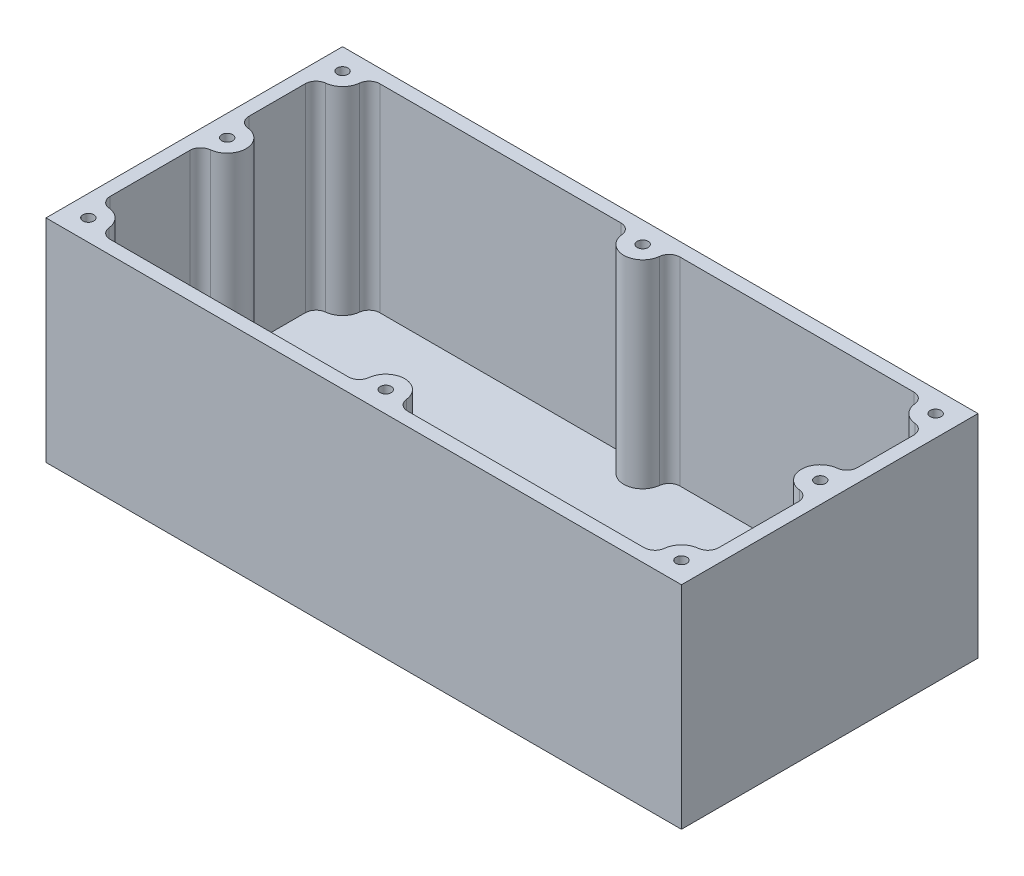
from build123d import *

# Parameters (mm, degrees)
SKETCH1_W             = 150
SKETCH1_H             = 70
BOSS_EXTRUDE1_DEPTH   = 50
F_5_40_TAPPED_HOLE1_D = 2.5781
SHELL1_T              = -3.175
FILLET5_R             = 2.54


with BuildPart() as part:
    # Sketch1 → Boss-Extrude1 (new body)
    with BuildSketch(Plane(origin=(0, 0, 0), x_dir=(1, 0, 0), z_dir=(0, 1, 0))):
        Rectangle(SKETCH1_W, SKETCH1_H)
    extrude(amount=BOSS_EXTRUDE1_DEPTH)

    # 5-40 Tapped Hole1 (through all)
    with Locations(Plane(origin=(0, 50, 0), x_dir=(1, 0, 0), z_dir=(0, 1, 0))):
        with Locations((70, 30), (70, 2.761337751), (70, -30), (0.19808968, -30), (0.846805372, 30), (-70, 30), (-70, 2.761337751), (-70, -30)):
            Hole(F_5_40_TAPPED_HOLE1_D / 2)

    # Shell1
    shell1_openings = [part.faces().sort_by_distance(p)[0] for p in [
        (-0.000521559, 50, 0.002756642),
    ]]
    offset(amount=SHELL1_T, openings=shell1_openings, kind=Kind.INTERSECTION)

    # Fillet5
    fillet5_edges = [part.edges().sort_by_distance(p)[0] for p in [
        (71.825, 26.5875, 25.926044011),
        (-65.926044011, 26.5875, -31.825),
        (-71.825, 26.5875, 25.926044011),
        (-65.926044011, 26.5875, 31.825),
        (-71.825, 26.5875, -6.83529374),
        (4.272045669, 26.5875, 31.825),
        (71.825, 26.5875, -6.83529374),
        (4.920761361, 26.5875, -31.825),
        (-3.875866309, 26.5875, 31.825),
        (-71.825, 26.5875, 1.312618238),
        (-71.825, 26.5875, -25.926044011),
        (-3.227150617, 26.5875, -31.825),
        (65.926044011, 26.5875, 31.825),
        (71.825, 26.5875, 1.312618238),
        (65.926044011, 26.5875, -31.825),
        (71.825, 26.5875, -25.926044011),
    ]]
    fillet(fillet5_edges, radius=FILLET5_R)


solid = part.part
